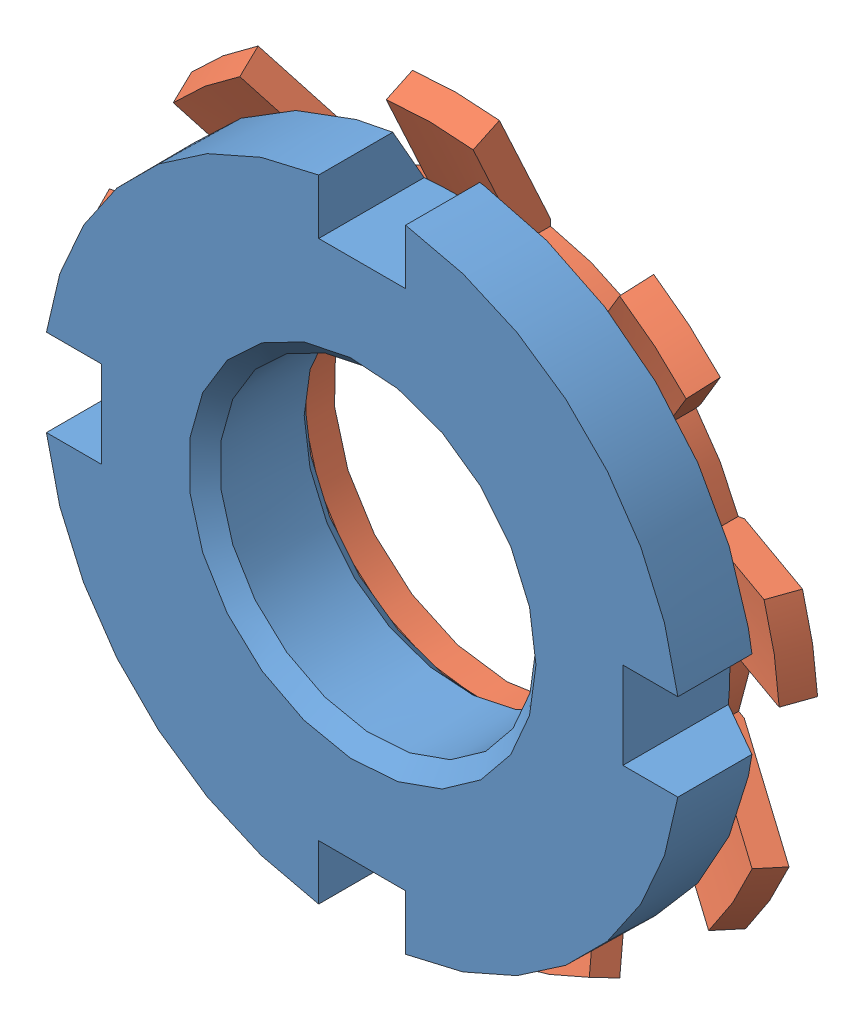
SolidWorks assembly JLNSK12.sldasm, configuration Default (file format 5000). Lengths in mm.
Overall size (24.96 24.67 6).
2 component instances, 2 part files, 0 mates.
Components (placement in the parent):
- JLNSK12nut-1: JLNSK12nut.sldprt [Default] at origin size (21.79 21.79 4)
- Washer12w-1: Washer12w.sldprt [Default] at (0 0 -5) size (24.96 24.67 3.67)
